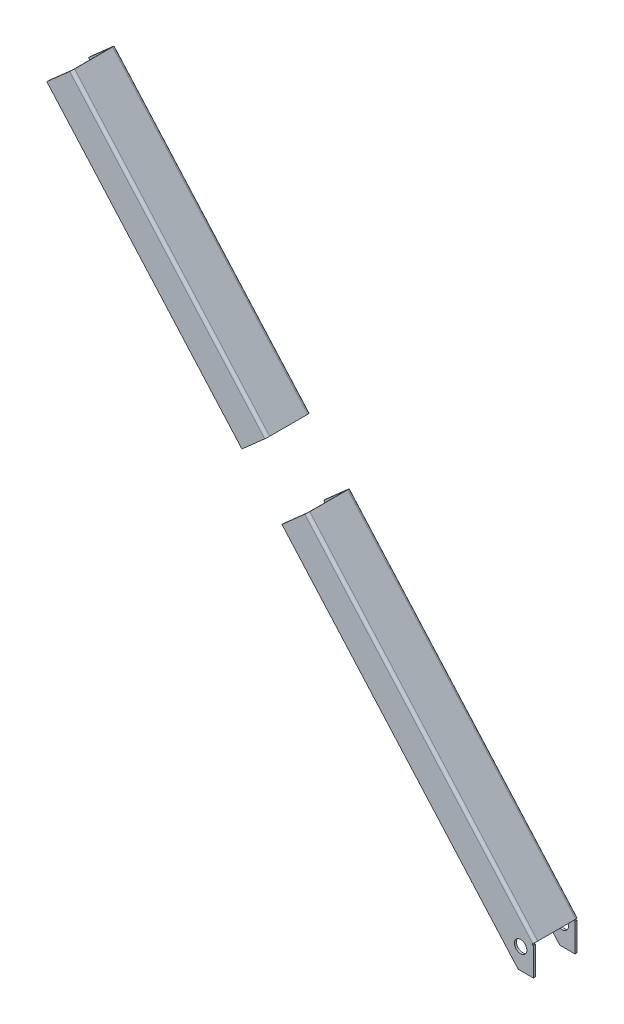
ISO-10303-21;
HEADER;
FILE_DESCRIPTION(('STEP AP214'),'2;1');
FILE_NAME('part.step','',(''),(''),'','','');
FILE_SCHEMA(('AUTOMOTIVE_DESIGN { 1 0 10303 214 1 1 1 1 }'));
ENDSEC;
DATA;
#1=APPLICATION_CONTEXT('core data for automotive mechanical design processes');
#2=APPLICATION_PROTOCOL_DEFINITION('international standard','automotive_design',2000,#1);
#3=PRODUCT_CONTEXT('',#1,'mechanical');
#4=PRODUCT('Part','Part','',(#3));
#5=PRODUCT_RELATED_PRODUCT_CATEGORY('part','',(#4));
#6=PRODUCT_DEFINITION_FORMATION('','',#4);
#7=PRODUCT_DEFINITION_CONTEXT('part definition',#1,'design');
#8=PRODUCT_DEFINITION('design','',#6,#7);
#9=PRODUCT_DEFINITION_SHAPE('','',#8);
#10=(LENGTH_UNIT() NAMED_UNIT(*) SI_UNIT(.MILLI.,.METRE.));
#11=(NAMED_UNIT(*) PLANE_ANGLE_UNIT() SI_UNIT($,.RADIAN.));
#12=(NAMED_UNIT(*) SI_UNIT($,.STERADIAN.) SOLID_ANGLE_UNIT());
#13=UNCERTAINTY_MEASURE_WITH_UNIT(LENGTH_MEASURE(1.E-05),#10,'distance_accuracy_value','');
#14=(GEOMETRIC_REPRESENTATION_CONTEXT(3) GLOBAL_UNCERTAINTY_ASSIGNED_CONTEXT((#13)) GLOBAL_UNIT_ASSIGNED_CONTEXT((#10,
#11,#12)) REPRESENTATION_CONTEXT('',''));
#15=CARTESIAN_POINT('',(0.,0.,0.));
#16=DIRECTION('',(0.,0.,1.));
#17=DIRECTION('',(1.,0.,0.));
#18=AXIS2_PLACEMENT_3D('',#15,#16,#17);
#19=CARTESIAN_POINT('',(142.888002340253,87.573537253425,130.));
#20=DIRECTION('',(0.662453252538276,-0.749103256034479,0.));
#21=DIRECTION('',(0.749103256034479,0.662453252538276,0.));
#22=AXIS2_PLACEMENT_3D('',#19,#20,#21);
#23=PLANE('',#22);
#24=DIRECTION('',(0.749103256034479,0.662453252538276,0.));
#25=VECTOR('',#24,1.);
#26=CARTESIAN_POINT('',(19.2475792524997,-21.7651951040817,40.0000000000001));
#27=LINE('',#26,#25);
#28=CARTESIAN_POINT('',(7.8529414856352,-31.8417964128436,40.0000000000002));
#29=VERTEX_POINT('',#28);
#30=CARTESIAN_POINT('',(29.7742497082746,-12.4561619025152,40.));
#31=VERTEX_POINT('',#30);
#32=EDGE_CURVE('E203',#29,#31,#27,.T.);
#33=ORIENTED_EDGE('',*,*,#32,.T.);
#34=DIRECTION('',(0.,0.,-1.));
#35=VECTOR('',#34,1.);
#36=CARTESIAN_POINT('',(29.7742497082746,-12.4561619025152,40.));
#37=LINE('',#36,#35);
#38=CARTESIAN_POINT('',(29.7742497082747,-12.456161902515,38.));
#39=VERTEX_POINT('',#38);
#40=EDGE_CURVE('E12',#31,#39,#37,.T.);
#41=ORIENTED_EDGE('',*,*,#40,.T.);
#42=DIRECTION('',(0.749103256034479,0.662453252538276,0.));
#43=VECTOR('',#42,1.);
#44=CARTESIAN_POINT('',(19.2475792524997,-21.7651951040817,38.0000000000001));
#45=LINE('',#44,#43);
#46=CARTESIAN_POINT('',(7.8529414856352,-31.8417964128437,38.0000000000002));
#47=VERTEX_POINT('',#46);
#48=EDGE_CURVE('E154',#47,#39,#45,.T.);
#49=ORIENTED_EDGE('',*,*,#48,.F.);
#50=DIRECTION('',(0.,0.,1.));
#51=VECTOR('',#50,1.);
#52=CARTESIAN_POINT('',(7.8529414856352,-31.8417964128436,40.0000000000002));
#53=LINE('',#52,#51);
#54=EDGE_CURVE('E206',#47,#29,#53,.T.);
#55=ORIENTED_EDGE('',*,*,#54,.T.);
#56=EDGE_LOOP('',(#33,#41,#49,#55));
#57=FACE_BOUND('',#56,.T.);
#58=ADVANCED_FACE('F49',(#57),#23,.F.);
#59=DIRECTION('',(0.,0.,-1.));
#60=VECTOR('',#59,1.);
#61=CARTESIAN_POINT('',(30.3260391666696,-11.9681988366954,0.));
#62=LINE('',#61,#60);
#63=CARTESIAN_POINT('',(30.3260391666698,-11.9681988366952,37.2634));
#64=VERTEX_POINT('',#63);
#65=CARTESIAN_POINT('',(30.3260391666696,-11.9681988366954,0.736600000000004));
#66=VERTEX_POINT('',#65);
#67=EDGE_CURVE('E220',#64,#66,#62,.T.);
#68=ORIENTED_EDGE('',*,*,#67,.F.);
#69=DIRECTION('',(0.749103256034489,0.662453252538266,0.));
#70=VECTOR('',#69,1.);
#71=CARTESIAN_POINT('',(30.3260391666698,-11.9681988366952,37.2634));
#72=LINE('',#71,#70);
#73=CARTESIAN_POINT('',(31.8242456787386,-10.6432923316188,37.2634));
#74=VERTEX_POINT('',#73);
#75=EDGE_CURVE('E58',#64,#74,#72,.T.);
#76=ORIENTED_EDGE('',*,*,#75,.T.);
#77=DIRECTION('',(0.,0.,-1.));
#78=VECTOR('',#77,1.);
#79=CARTESIAN_POINT('',(31.8242456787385,-10.6432923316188,0.));
#80=LINE('',#79,#78);
#81=CARTESIAN_POINT('',(31.8242456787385,-10.6432923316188,0.736599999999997));
#82=VERTEX_POINT('',#81);
#83=EDGE_CURVE('E198',#74,#82,#80,.T.);
#84=ORIENTED_EDGE('',*,*,#83,.T.);
#85=DIRECTION('',(-0.749103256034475,-0.662453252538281,0.));
#86=VECTOR('',#85,1.);
#87=CARTESIAN_POINT('',(31.8242456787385,-10.6432923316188,0.736599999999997));
#88=LINE('',#87,#86);
#89=EDGE_CURVE('E66',#82,#66,#88,.T.);
#90=ORIENTED_EDGE('',*,*,#89,.T.);
#91=EDGE_LOOP('',(#68,#76,#84,#90));
#92=FACE_BOUND('',#91,.T.);
#93=ADVANCED_FACE('F420',(#92),#23,.F.);
#94=DIRECTION('',(-0.749103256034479,-0.662453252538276,0.));
#95=VECTOR('',#94,1.);
#96=CARTESIAN_POINT('',(19.2475792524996,-21.7651951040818,0.));
#97=LINE('',#96,#95);
#98=CARTESIAN_POINT('',(29.7742497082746,-12.456161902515,0.));
#99=VERTEX_POINT('',#98);
#100=CARTESIAN_POINT('',(7.85294148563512,-31.8417964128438,0.));
#101=VERTEX_POINT('',#100);
#102=EDGE_CURVE('E210',#99,#101,#97,.T.);
#103=ORIENTED_EDGE('',*,*,#102,.F.);
#104=DIRECTION('',(0.,0.,-1.));
#105=VECTOR('',#104,1.);
#106=CARTESIAN_POINT('',(29.7742497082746,-12.456161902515,0.));
#107=LINE('',#106,#105);
#108=CARTESIAN_POINT('',(29.7742497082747,-12.456161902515,-2.));
#109=VERTEX_POINT('',#108);
#110=EDGE_CURVE('E102',#99,#109,#107,.T.);
#111=ORIENTED_EDGE('',*,*,#110,.T.);
#112=DIRECTION('',(-0.749103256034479,-0.662453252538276,0.));
#113=VECTOR('',#112,1.);
#114=CARTESIAN_POINT('',(142.888002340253,87.573537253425,-2.));
#115=LINE('',#114,#113);
#116=CARTESIAN_POINT('',(7.85294148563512,-31.8417964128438,-2.));
#117=VERTEX_POINT('',#116);
#118=EDGE_CURVE('E98',#109,#117,#115,.T.);
#119=ORIENTED_EDGE('',*,*,#118,.T.);
#120=DIRECTION('',(0.,0.,1.));
#121=VECTOR('',#120,1.);
#122=CARTESIAN_POINT('',(7.85294148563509,-31.8417964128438,-2.));
#123=LINE('',#122,#121);
#124=EDGE_CURVE('E204',#117,#101,#123,.T.);
#125=ORIENTED_EDGE('',*,*,#124,.T.);
#126=EDGE_LOOP('',(#103,#111,#119,#125));
#127=FACE_BOUND('',#126,.T.);
#128=ADVANCED_FACE('F455',(#127),#23,.F.);
#129=ORIENTED_EDGE('',*,*,#40,.F.);
#130=CARTESIAN_POINT('',(29.7742497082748,-12.4561619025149,37.2634));
#131=DIRECTION('',(0.662453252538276,-0.749103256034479,0.));
#132=DIRECTION('',(0.749103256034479,0.662453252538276,0.));
#133=AXIS2_PLACEMENT_3D('',#130,#131,#132);
#134=CIRCLE('',#133,2.73659999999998);
#135=EDGE_CURVE('E200',#31,#74,#134,.F.);
#136=ORIENTED_EDGE('',*,*,#135,.T.);
#137=ORIENTED_EDGE('',*,*,#75,.F.);
#138=CARTESIAN_POINT('',(29.7742497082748,-12.4561619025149,37.2634));
#139=DIRECTION('',(0.662453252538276,-0.749103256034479,0.));
#140=DIRECTION('',(0.749103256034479,0.662453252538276,0.));
#141=AXIS2_PLACEMENT_3D('',#138,#139,#140);
#142=CIRCLE('',#141,0.736599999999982);
#143=EDGE_CURVE('E252',#39,#64,#142,.F.);
#144=ORIENTED_EDGE('',*,*,#143,.F.);
#145=EDGE_LOOP('',(#129,#136,#137,#144));
#146=FACE_BOUND('',#145,.T.);
#147=ADVANCED_FACE('F417',(#146),#23,.F.);
#148=CARTESIAN_POINT('',(0.,0.,-2.));
#149=DIRECTION('',(0.,0.,-1.));
#150=DIRECTION('',(-1.,0.,0.));
#151=AXIS2_PLACEMENT_3D('',#148,#149,#150);
#152=PLANE('',#151);
#153=ORIENTED_EDGE('',*,*,#118,.F.);
#154=DIRECTION('',(-0.662453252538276,0.749103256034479,0.));
#155=VECTOR('',#154,1.);
#156=CARTESIAN_POINT('',(-234.983443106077,286.932283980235,-1.99999999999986));
#157=LINE('',#156,#155);
#158=CARTESIAN_POINT('',(248.942582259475,-260.292082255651,-2.));
#159=VERTEX_POINT('',#158);
#160=EDGE_CURVE('E232',#109,#159,#157,.F.);
#161=ORIENTED_EDGE('',*,*,#160,.T.);
#162=DIRECTION('',(-0.749103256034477,-0.662453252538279,0.));
#163=VECTOR('',#162,1.);
#164=CARTESIAN_POINT('',(238.415911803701,-269.601115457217,-2.));
#165=LINE('',#164,#163);
#166=CARTESIAN_POINT('',(248.193479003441,-260.954535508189,-2.));
#167=VERTEX_POINT('',#166);
#168=EDGE_CURVE('E235',#159,#167,#165,.T.);
#169=ORIENTED_EDGE('',*,*,#168,.T.);
#170=DIRECTION('',(0.662453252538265,-0.749103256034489,0.));
#171=VECTOR('',#170,1.);
#172=CARTESIAN_POINT('',(9.77756719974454,8.64657994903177,-2.));
#173=LINE('',#172,#171);
#174=CARTESIAN_POINT('',(248.855932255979,-261.703638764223,-2.));
#175=VERTEX_POINT('',#174);
#176=EDGE_CURVE('E288',#167,#175,#173,.T.);
#177=ORIENTED_EDGE('',*,*,#176,.T.);
#178=DIRECTION('',(0.749103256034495,0.662453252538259,0.));
#179=VECTOR('',#178,1.);
#180=CARTESIAN_POINT('',(239.078365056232,-270.350218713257,-2.));
#181=LINE('',#180,#179);
#182=CARTESIAN_POINT('',(249.49437171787,-261.139048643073,-2.));
#183=VERTEX_POINT('',#182);
#184=EDGE_CURVE('E285',#175,#183,#181,.T.);
#185=ORIENTED_EDGE('',*,*,#184,.T.);
#186=DIRECTION('',(0.,1.,0.));
#187=VECTOR('',#186,1.);
#188=CARTESIAN_POINT('',(249.49437171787,-288.579752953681,-2.));
#189=LINE('',#188,#187);
#190=CARTESIAN_POINT('',(249.49437171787,-288.579752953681,-2.));
#191=VERTEX_POINT('',#190);
#192=EDGE_CURVE('E264',#191,#183,#189,.T.);
#193=ORIENTED_EDGE('',*,*,#192,.F.);
#194=DIRECTION('',(1.,0.,0.));
#195=VECTOR('',#194,1.);
#196=CARTESIAN_POINT('',(249.49437171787,-288.579752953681,-2.));
#197=LINE('',#196,#195);
#198=CARTESIAN_POINT('',(234.893597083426,-288.57975295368,-2.));
#199=VERTEX_POINT('',#198);
#200=EDGE_CURVE('E271',#199,#191,#197,.T.);
#201=ORIENTED_EDGE('',*,*,#200,.F.);
#202=DIRECTION('',(0.662453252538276,-0.749103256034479,0.));
#203=VECTOR('',#202,1.);
#204=CARTESIAN_POINT('',(-249.032428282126,258.644613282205,-2.));
#205=LINE('',#204,#203);
#206=EDGE_CURVE('E227',#117,#199,#205,.T.);
#207=ORIENTED_EDGE('',*,*,#206,.F.);
#208=EDGE_LOOP('',(#153,#161,#169,#177,#185,#193,#201,#207));
#209=FACE_BOUND('',#208,.T.);
#210=CARTESIAN_POINT('',(237.23097171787,-268.57975295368,-2.));
#211=DIRECTION('',(0.,0.,1.));
#212=DIRECTION('',(1.,0.,0.));
#213=AXIS2_PLACEMENT_3D('',#210,#211,#212);
#214=CIRCLE('',#213,6.00000000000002);
#215=CARTESIAN_POINT('',(243.23097171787,-268.57975295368,-2.));
#216=VERTEX_POINT('',#215);
#217=EDGE_CURVE('E214',#216,#216,#214,.T.);
#218=ORIENTED_EDGE('',*,*,#217,.T.);
#219=EDGE_LOOP('',(#218));
#220=FACE_BOUND('',#219,.T.);
#221=ADVANCED_FACE('F51',(#209,#220),#152,.T.);
#222=CARTESIAN_POINT('',(0.,0.,0.));
#223=DIRECTION('',(0.,0.,-1.));
#224=DIRECTION('',(-1.,0.,0.));
#225=AXIS2_PLACEMENT_3D('',#222,#223,#224);
#226=PLANE('',#225);
#227=CARTESIAN_POINT('',(237.23097171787,-268.57975295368,0.));
#228=DIRECTION('',(0.,0.,1.));
#229=DIRECTION('',(1.,0.,0.));
#230=AXIS2_PLACEMENT_3D('',#227,#228,#229);
#231=CIRCLE('',#230,6.00000000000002);
#232=CARTESIAN_POINT('',(243.23097171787,-268.57975295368,0.));
#233=VERTEX_POINT('',#232);
#234=EDGE_CURVE('E270',#233,#233,#231,.T.);
#235=ORIENTED_EDGE('',*,*,#234,.F.);
#236=EDGE_LOOP('',(#235));
#237=FACE_BOUND('',#236,.T.);
#238=DIRECTION('',(-0.662453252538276,0.749103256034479,0.));
#239=VECTOR('',#238,1.);
#240=CARTESIAN_POINT('',(-234.983443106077,286.932283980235,1.35742111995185E-13));
#241=LINE('',#240,#239);
#242=CARTESIAN_POINT('',(248.942582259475,-260.292082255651,0.));
#243=VERTEX_POINT('',#242);
#244=EDGE_CURVE('E218',#99,#243,#241,.F.);
#245=ORIENTED_EDGE('',*,*,#244,.F.);
#246=ORIENTED_EDGE('',*,*,#102,.T.);
#247=DIRECTION('',(0.662453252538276,-0.749103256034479,0.));
#248=VECTOR('',#247,1.);
#249=CARTESIAN_POINT('',(-249.032428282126,258.644613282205,0.));
#250=LINE('',#249,#248);
#251=CARTESIAN_POINT('',(234.893597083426,-288.57975295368,0.));
#252=VERTEX_POINT('',#251);
#253=EDGE_CURVE('E213',#101,#252,#250,.T.);
#254=ORIENTED_EDGE('',*,*,#253,.T.);
#255=DIRECTION('',(1.,0.,0.));
#256=VECTOR('',#255,1.);
#257=CARTESIAN_POINT('',(249.49437171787,-288.579752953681,0.));
#258=LINE('',#257,#256);
#259=CARTESIAN_POINT('',(249.49437171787,-288.579752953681,0.));
#260=VERTEX_POINT('',#259);
#261=EDGE_CURVE('E261',#252,#260,#258,.T.);
#262=ORIENTED_EDGE('',*,*,#261,.T.);
#263=DIRECTION('',(0.,1.,0.));
#264=VECTOR('',#263,1.);
#265=CARTESIAN_POINT('',(249.49437171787,-288.579752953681,0.));
#266=LINE('',#265,#264);
#267=CARTESIAN_POINT('',(249.49437171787,-261.139048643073,0.));
#268=VERTEX_POINT('',#267);
#269=EDGE_CURVE('E231',#260,#268,#266,.T.);
#270=ORIENTED_EDGE('',*,*,#269,.T.);
#271=DIRECTION('',(0.749103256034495,0.662453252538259,0.));
#272=VECTOR('',#271,1.);
#273=CARTESIAN_POINT('',(248.855932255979,-261.703638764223,0.));
#274=LINE('',#273,#272);
#275=CARTESIAN_POINT('',(248.855932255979,-261.703638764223,0.));
#276=VERTEX_POINT('',#275);
#277=EDGE_CURVE('E300',#276,#268,#274,.T.);
#278=ORIENTED_EDGE('',*,*,#277,.F.);
#279=DIRECTION('',(0.662453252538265,-0.749103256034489,0.));
#280=VECTOR('',#279,1.);
#281=CARTESIAN_POINT('',(248.193479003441,-260.954535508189,0.));
#282=LINE('',#281,#280);
#283=CARTESIAN_POINT('',(248.193479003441,-260.954535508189,0.));
#284=VERTEX_POINT('',#283);
#285=EDGE_CURVE('E296',#284,#276,#282,.T.);
#286=ORIENTED_EDGE('',*,*,#285,.F.);
#287=DIRECTION('',(-0.749103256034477,-0.662453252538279,0.));
#288=VECTOR('',#287,1.);
#289=CARTESIAN_POINT('',(248.942582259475,-260.292082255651,0.));
#290=LINE('',#289,#288);
#291=EDGE_CURVE('E282',#243,#284,#290,.T.);
#292=ORIENTED_EDGE('',*,*,#291,.F.);
#293=EDGE_LOOP('',(#245,#246,#254,#262,#270,#278,#286,#292));
#294=FACE_BOUND('',#293,.T.);
#295=ADVANCED_FACE('F452',(#237,#294),#226,.F.);
#296=CARTESIAN_POINT('',(-249.032428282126,258.644613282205,-2.));
#297=DIRECTION('',(-0.749103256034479,-0.662453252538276,0.));
#298=DIRECTION('',(0.662453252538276,-0.749103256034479,0.));
#299=AXIS2_PLACEMENT_3D('',#296,#297,#298);
#300=PLANE('',#299);
#301=ORIENTED_EDGE('',*,*,#124,.F.);
#302=ORIENTED_EDGE('',*,*,#206,.T.);
#303=DIRECTION('',(0.,0.,1.));
#304=VECTOR('',#303,1.);
#305=CARTESIAN_POINT('',(234.893597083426,-288.57975295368,-2.));
#306=LINE('',#305,#304);
#307=EDGE_CURVE('E230',#199,#252,#306,.T.);
#308=ORIENTED_EDGE('',*,*,#307,.T.);
#309=ORIENTED_EDGE('',*,*,#253,.F.);
#310=EDGE_LOOP('',(#301,#302,#308,#309));
#311=FACE_BOUND('',#310,.T.);
#312=ADVANCED_FACE('F444',(#311),#300,.T.);
#313=CARTESIAN_POINT('',(-234.983443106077,286.932283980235,0.736600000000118));
#314=DIRECTION('',(-0.662453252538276,0.749103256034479,0.));
#315=DIRECTION('',(0.749103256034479,0.662453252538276,0.));
#316=AXIS2_PLACEMENT_3D('',#313,#314,#315);
#317=CYLINDRICAL_SURFACE('',#316,2.73659999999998);
#318=CARTESIAN_POINT('',(29.7742497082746,-12.456161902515,0.736600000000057));
#319=DIRECTION('',(0.662453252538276,-0.749103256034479,0.));
#320=DIRECTION('',(0.749103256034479,0.662453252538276,0.));
#321=AXIS2_PLACEMENT_3D('',#318,#319,#320);
#322=CIRCLE('',#321,2.73659999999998);
#323=EDGE_CURVE('E168',#82,#109,#322,.F.);
#324=ORIENTED_EDGE('',*,*,#323,.F.);
#325=DIRECTION('',(-0.662453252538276,0.749103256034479,0.));
#326=VECTOR('',#325,1.);
#327=CARTESIAN_POINT('',(12.5766664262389,11.121902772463,0.736600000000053));
#328=LINE('',#327,#326);
#329=CARTESIAN_POINT('',(250.992578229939,-258.479212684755,0.736599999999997));
#330=VERTEX_POINT('',#329);
#331=EDGE_CURVE('E239',#330,#82,#328,.T.);
#332=ORIENTED_EDGE('',*,*,#331,.F.);
#333=CARTESIAN_POINT('',(248.942582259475,-260.292082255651,0.736600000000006));
#334=DIRECTION('',(-0.662453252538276,0.749103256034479,0.));
#335=DIRECTION('',(-0.749103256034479,-0.662453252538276,0.));
#336=AXIS2_PLACEMENT_3D('',#333,#334,#335);
#337=CIRCLE('',#336,2.73659999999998);
#338=EDGE_CURVE('E313',#159,#330,#337,.F.);
#339=ORIENTED_EDGE('',*,*,#338,.F.);
#340=ORIENTED_EDGE('',*,*,#160,.F.);
#341=EDGE_LOOP('',(#324,#332,#339,#340));
#342=FACE_BOUND('',#341,.T.);
#343=ADVANCED_FACE('F434',(#342),#317,.T.);
#344=CARTESIAN_POINT('',(-234.983443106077,286.932283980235,0.736600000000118));
#345=DIRECTION('',(-0.662453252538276,0.749103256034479,0.));
#346=DIRECTION('',(0.749103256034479,0.662453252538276,0.));
#347=AXIS2_PLACEMENT_3D('',#344,#345,#346);
#348=CYLINDRICAL_SURFACE('',#347,0.736599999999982);
#349=DIRECTION('',(-0.662453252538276,0.749103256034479,0.));
#350=VECTOR('',#349,1.);
#351=CARTESIAN_POINT('',(249.49437171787,-259.804119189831,0.736600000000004));
#352=LINE('',#351,#350);
#353=CARTESIAN_POINT('',(249.49437171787,-259.804119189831,0.736600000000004));
#354=VERTEX_POINT('',#353);
#355=EDGE_CURVE('E219',#354,#66,#352,.T.);
#356=ORIENTED_EDGE('',*,*,#355,.T.);
#357=CARTESIAN_POINT('',(29.7742497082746,-12.456161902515,0.736600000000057));
#358=DIRECTION('',(0.662453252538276,-0.749103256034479,0.));
#359=DIRECTION('',(0.749103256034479,0.662453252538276,0.));
#360=AXIS2_PLACEMENT_3D('',#357,#358,#359);
#361=CIRCLE('',#360,0.736599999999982);
#362=EDGE_CURVE('E215',#66,#99,#361,.F.);
#363=ORIENTED_EDGE('',*,*,#362,.T.);
#364=ORIENTED_EDGE('',*,*,#244,.T.);
#365=CARTESIAN_POINT('',(248.942582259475,-260.292082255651,0.736600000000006));
#366=DIRECTION('',(-0.662453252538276,0.749103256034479,0.));
#367=DIRECTION('',(-0.749103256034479,-0.662453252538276,0.));
#368=AXIS2_PLACEMENT_3D('',#365,#366,#367);
#369=CIRCLE('',#368,0.736599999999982);
#370=EDGE_CURVE('E238',#243,#354,#369,.F.);
#371=ORIENTED_EDGE('',*,*,#370,.T.);
#372=EDGE_LOOP('',(#356,#363,#364,#371));
#373=FACE_BOUND('',#372,.T.);
#374=ADVANCED_FACE('F457',(#373),#348,.F.);
#375=CARTESIAN_POINT('',(12.5766664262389,11.121902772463,0.));
#376=DIRECTION('',(0.749103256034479,0.662453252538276,0.));
#377=DIRECTION('',(-0.662453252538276,0.749103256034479,0.));
#378=AXIS2_PLACEMENT_3D('',#375,#376,#377);
#379=PLANE('',#378);
#380=ORIENTED_EDGE('',*,*,#83,.F.);
#381=DIRECTION('',(-0.662453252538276,0.749103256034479,0.));
#382=VECTOR('',#381,1.);
#383=CARTESIAN_POINT('',(12.576666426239,11.1219027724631,37.2634));
#384=LINE('',#383,#382);
#385=CARTESIAN_POINT('',(250.992578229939,-258.479212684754,37.2634));
#386=VERTEX_POINT('',#385);
#387=EDGE_CURVE('E194',#386,#74,#384,.T.);
#388=ORIENTED_EDGE('',*,*,#387,.F.);
#389=DIRECTION('',(0.,0.,1.));
#390=VECTOR('',#389,1.);
#391=CARTESIAN_POINT('',(250.992578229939,-258.479212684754,19.));
#392=LINE('',#391,#390);
#393=EDGE_CURVE('E320',#330,#386,#392,.T.);
#394=ORIENTED_EDGE('',*,*,#393,.F.);
#395=ORIENTED_EDGE('',*,*,#331,.T.);
#396=EDGE_LOOP('',(#380,#388,#394,#395));
#397=FACE_BOUND('',#396,.T.);
#398=ADVANCED_FACE('F430',(#397),#379,.T.);
#399=CARTESIAN_POINT('',(11.07845991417,9.79699626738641,0.));
#400=DIRECTION('',(0.749103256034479,0.662453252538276,0.));
#401=DIRECTION('',(-0.662453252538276,0.749103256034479,0.));
#402=AXIS2_PLACEMENT_3D('',#399,#400,#401);
#403=PLANE('',#402);
#404=DIRECTION('',(-0.662453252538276,0.749103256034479,0.));
#405=VECTOR('',#404,1.);
#406=CARTESIAN_POINT('',(249.49437171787,-259.804119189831,37.2634));
#407=LINE('',#406,#405);
#408=CARTESIAN_POINT('',(249.49437171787,-259.804119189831,37.2634));
#409=VERTEX_POINT('',#408);
#410=EDGE_CURVE('E164',#409,#64,#407,.T.);
#411=ORIENTED_EDGE('',*,*,#410,.T.);
#412=ORIENTED_EDGE('',*,*,#67,.T.);
#413=ORIENTED_EDGE('',*,*,#355,.F.);
#414=DIRECTION('',(0.,0.,1.));
#415=VECTOR('',#414,1.);
#416=CARTESIAN_POINT('',(249.49437171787,-259.804119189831,19.));
#417=LINE('',#416,#415);
#418=EDGE_CURVE('E223',#354,#409,#417,.T.);
#419=ORIENTED_EDGE('',*,*,#418,.T.);
#420=EDGE_LOOP('',(#411,#412,#413,#419));
#421=FACE_BOUND('',#420,.T.);
#422=ADVANCED_FACE('F423',(#421),#403,.F.);
#423=CARTESIAN_POINT('',(1.09850161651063E-13,0.,40.0000000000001));
#424=DIRECTION('',(0.,0.,1.));
#425=DIRECTION('',(-1.,0.,0.));
#426=AXIS2_PLACEMENT_3D('',#423,#424,#425);
#427=PLANE('',#426);
#428=ORIENTED_EDGE('',*,*,#32,.F.);
#429=DIRECTION('',(0.662453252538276,-0.749103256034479,0.));
#430=VECTOR('',#429,1.);
#431=CARTESIAN_POINT('',(-249.032428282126,258.644613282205,40.0000000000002));
#432=LINE('',#431,#430);
#433=CARTESIAN_POINT('',(234.893597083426,-288.57975295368,40.0000000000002));
#434=VERTEX_POINT('',#433);
#435=EDGE_CURVE('E244',#29,#434,#432,.T.);
#436=ORIENTED_EDGE('',*,*,#435,.T.);
#437=DIRECTION('',(1.,0.,0.));
#438=VECTOR('',#437,1.);
#439=CARTESIAN_POINT('',(249.49437171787,-288.57975295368,40.0000000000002));
#440=LINE('',#439,#438);
#441=CARTESIAN_POINT('',(249.49437171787,-288.57975295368,40.0000000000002));
#442=VERTEX_POINT('',#441);
#443=EDGE_CURVE('E246',#434,#442,#440,.T.);
#444=ORIENTED_EDGE('',*,*,#443,.T.);
#445=DIRECTION('',(0.,1.,0.));
#446=VECTOR('',#445,1.);
#447=CARTESIAN_POINT('',(249.49437171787,-288.57975295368,40.0000000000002));
#448=LINE('',#447,#446);
#449=CARTESIAN_POINT('',(249.49437171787,-261.139048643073,40.));
#450=VERTEX_POINT('',#449);
#451=EDGE_CURVE('E339',#442,#450,#448,.T.);
#452=ORIENTED_EDGE('',*,*,#451,.T.);
#453=DIRECTION('',(0.749103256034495,0.662453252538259,0.));
#454=VECTOR('',#453,1.);
#455=CARTESIAN_POINT('',(239.078365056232,-270.350218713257,40.0000000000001));
#456=LINE('',#455,#454);
#457=CARTESIAN_POINT('',(248.855932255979,-261.703638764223,40.));
#458=VERTEX_POINT('',#457);
#459=EDGE_CURVE('E348',#458,#450,#456,.T.);
#460=ORIENTED_EDGE('',*,*,#459,.F.);
#461=DIRECTION('',(0.662453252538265,-0.749103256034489,0.));
#462=VECTOR('',#461,1.);
#463=CARTESIAN_POINT('',(9.77756719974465,8.64657994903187,40.));
#464=LINE('',#463,#462);
#465=CARTESIAN_POINT('',(248.193479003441,-260.954535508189,40.));
#466=VERTEX_POINT('',#465);
#467=EDGE_CURVE('E180',#466,#458,#464,.T.);
#468=ORIENTED_EDGE('',*,*,#467,.F.);
#469=DIRECTION('',(-0.749103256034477,-0.662453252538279,0.));
#470=VECTOR('',#469,1.);
#471=CARTESIAN_POINT('',(238.415911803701,-269.601115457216,40.0000000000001));
#472=LINE('',#471,#470);
#473=CARTESIAN_POINT('',(248.942582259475,-260.292082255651,40.));
#474=VERTEX_POINT('',#473);
#475=EDGE_CURVE('E181',#474,#466,#472,.T.);
#476=ORIENTED_EDGE('',*,*,#475,.F.);
#477=DIRECTION('',(-0.662453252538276,0.749103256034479,0.));
#478=VECTOR('',#477,1.);
#479=CARTESIAN_POINT('',(-234.983443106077,286.932283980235,39.9999999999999));
#480=LINE('',#479,#478);
#481=EDGE_CURVE('E195',#31,#474,#480,.F.);
#482=ORIENTED_EDGE('',*,*,#481,.F.);
#483=EDGE_LOOP('',(#428,#436,#444,#452,#460,#468,#476,#482));
#484=FACE_BOUND('',#483,.T.);
#485=CARTESIAN_POINT('',(237.23097171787,-268.57975295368,40.0000000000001));
#486=DIRECTION('',(0.,0.,1.));
#487=DIRECTION('',(1.,0.,0.));
#488=AXIS2_PLACEMENT_3D('',#485,#486,#487);
#489=CIRCLE('',#488,6.00000000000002);
#490=CARTESIAN_POINT('',(243.23097171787,-268.57975295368,40.0000000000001));
#491=VERTEX_POINT('',#490);
#492=EDGE_CURVE('E329',#491,#491,#489,.T.);
#493=ORIENTED_EDGE('',*,*,#492,.F.);
#494=EDGE_LOOP('',(#493));
#495=FACE_BOUND('',#494,.T.);
#496=ADVANCED_FACE('F375',(#484,#495),#427,.T.);
#497=CARTESIAN_POINT('',(0.,0.,38.0000000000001));
#498=DIRECTION('',(0.,0.,1.));
#499=DIRECTION('',(-1.,0.,0.));
#500=AXIS2_PLACEMENT_3D('',#497,#498,#499);
#501=PLANE('',#500);
#502=CARTESIAN_POINT('',(237.23097171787,-268.57975295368,38.0000000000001));
#503=DIRECTION('',(0.,0.,1.));
#504=DIRECTION('',(1.,0.,0.));
#505=AXIS2_PLACEMENT_3D('',#502,#503,#504);
#506=CIRCLE('',#505,6.00000000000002);
#507=CARTESIAN_POINT('',(243.23097171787,-268.57975295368,38.0000000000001));
#508=VERTEX_POINT('',#507);
#509=EDGE_CURVE('E225',#508,#508,#506,.T.);
#510=ORIENTED_EDGE('',*,*,#509,.T.);
#511=EDGE_LOOP('',(#510));
#512=FACE_BOUND('',#511,.T.);
#513=DIRECTION('',(0.662453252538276,-0.749103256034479,0.));
#514=VECTOR('',#513,1.);
#515=CARTESIAN_POINT('',(-249.032428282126,258.644613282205,38.0000000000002));
#516=LINE('',#515,#514);
#517=CARTESIAN_POINT('',(234.893597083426,-288.57975295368,38.0000000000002));
#518=VERTEX_POINT('',#517);
#519=EDGE_CURVE('E248',#47,#518,#516,.T.);
#520=ORIENTED_EDGE('',*,*,#519,.F.);
#521=ORIENTED_EDGE('',*,*,#48,.T.);
#522=DIRECTION('',(-0.662453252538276,0.749103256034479,0.));
#523=VECTOR('',#522,1.);
#524=CARTESIAN_POINT('',(-234.983443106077,286.932283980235,37.9999999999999));
#525=LINE('',#524,#523);
#526=CARTESIAN_POINT('',(248.942582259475,-260.292082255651,38.));
#527=VERTEX_POINT('',#526);
#528=EDGE_CURVE('E147',#39,#527,#525,.F.);
#529=ORIENTED_EDGE('',*,*,#528,.T.);
#530=DIRECTION('',(-0.749103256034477,-0.662453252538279,0.));
#531=VECTOR('',#530,1.);
#532=CARTESIAN_POINT('',(248.942582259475,-260.292082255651,38.));
#533=LINE('',#532,#531);
#534=CARTESIAN_POINT('',(248.193479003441,-260.954535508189,38.));
#535=VERTEX_POINT('',#534);
#536=EDGE_CURVE('E153',#527,#535,#533,.T.);
#537=ORIENTED_EDGE('',*,*,#536,.T.);
#538=DIRECTION('',(0.662453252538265,-0.749103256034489,0.));
#539=VECTOR('',#538,1.);
#540=CARTESIAN_POINT('',(248.193479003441,-260.954535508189,38.));
#541=LINE('',#540,#539);
#542=CARTESIAN_POINT('',(248.855932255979,-261.703638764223,38.));
#543=VERTEX_POINT('',#542);
#544=EDGE_CURVE('E187',#535,#543,#541,.T.);
#545=ORIENTED_EDGE('',*,*,#544,.T.);
#546=DIRECTION('',(0.749103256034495,0.662453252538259,0.));
#547=VECTOR('',#546,1.);
#548=CARTESIAN_POINT('',(248.855932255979,-261.703638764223,38.));
#549=LINE('',#548,#547);
#550=CARTESIAN_POINT('',(249.49437171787,-261.139048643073,38.));
#551=VERTEX_POINT('',#550);
#552=EDGE_CURVE('E189',#543,#551,#549,.T.);
#553=ORIENTED_EDGE('',*,*,#552,.T.);
#554=DIRECTION('',(0.,1.,0.));
#555=VECTOR('',#554,1.);
#556=CARTESIAN_POINT('',(249.49437171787,-288.57975295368,38.0000000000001));
#557=LINE('',#556,#555);
#558=CARTESIAN_POINT('',(249.49437171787,-288.57975295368,38.0000000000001));
#559=VERTEX_POINT('',#558);
#560=EDGE_CURVE('E333',#559,#551,#557,.T.);
#561=ORIENTED_EDGE('',*,*,#560,.F.);
#562=DIRECTION('',(1.,0.,0.));
#563=VECTOR('',#562,1.);
#564=CARTESIAN_POINT('',(249.49437171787,-288.57975295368,38.0000000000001));
#565=LINE('',#564,#563);
#566=EDGE_CURVE('E330',#518,#559,#565,.T.);
#567=ORIENTED_EDGE('',*,*,#566,.F.);
#568=EDGE_LOOP('',(#520,#521,#529,#537,#545,#553,#561,#567));
#569=FACE_BOUND('',#568,.T.);
#570=ADVANCED_FACE('F150',(#512,#569),#501,.F.);
#571=CARTESIAN_POINT('',(-249.032428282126,258.644613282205,40.0000000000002));
#572=DIRECTION('',(-0.749103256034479,-0.662453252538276,0.));
#573=DIRECTION('',(0.662453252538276,-0.749103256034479,0.));
#574=AXIS2_PLACEMENT_3D('',#571,#572,#573);
#575=PLANE('',#574);
#576=ORIENTED_EDGE('',*,*,#54,.F.);
#577=ORIENTED_EDGE('',*,*,#519,.T.);
#578=DIRECTION('',(0.,0.,-1.));
#579=VECTOR('',#578,1.);
#580=CARTESIAN_POINT('',(234.893597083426,-288.57975295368,40.0000000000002));
#581=LINE('',#580,#579);
#582=EDGE_CURVE('E326',#434,#518,#581,.T.);
#583=ORIENTED_EDGE('',*,*,#582,.F.);
#584=ORIENTED_EDGE('',*,*,#435,.F.);
#585=EDGE_LOOP('',(#576,#577,#583,#584));
#586=FACE_BOUND('',#585,.T.);
#587=ADVANCED_FACE('F368',(#586),#575,.T.);
#588=CARTESIAN_POINT('',(-234.983443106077,286.932283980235,37.2633999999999));
#589=DIRECTION('',(-0.662453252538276,0.749103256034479,0.));
#590=DIRECTION('',(0.749103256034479,0.662453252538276,0.));
#591=AXIS2_PLACEMENT_3D('',#588,#589,#590);
#592=CYLINDRICAL_SURFACE('',#591,2.73659999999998);
#593=ORIENTED_EDGE('',*,*,#135,.F.);
#594=ORIENTED_EDGE('',*,*,#481,.T.);
#595=CARTESIAN_POINT('',(248.942582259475,-260.292082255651,37.2634));
#596=DIRECTION('',(0.662453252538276,-0.749103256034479,0.));
#597=DIRECTION('',(-0.749103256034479,-0.662453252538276,0.));
#598=AXIS2_PLACEMENT_3D('',#595,#596,#597);
#599=CIRCLE('',#598,2.73659999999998);
#600=EDGE_CURVE('E176',#474,#386,#599,.F.);
#601=ORIENTED_EDGE('',*,*,#600,.T.);
#602=ORIENTED_EDGE('',*,*,#387,.T.);
#603=EDGE_LOOP('',(#593,#594,#601,#602));
#604=FACE_BOUND('',#603,.T.);
#605=ADVANCED_FACE('F379',(#604),#592,.T.);
#606=CARTESIAN_POINT('',(-234.983443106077,286.932283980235,37.2633999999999));
#607=DIRECTION('',(-0.662453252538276,0.749103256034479,0.));
#608=DIRECTION('',(0.749103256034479,0.662453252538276,0.));
#609=AXIS2_PLACEMENT_3D('',#606,#607,#608);
#610=CYLINDRICAL_SURFACE('',#609,0.736599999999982);
#611=ORIENTED_EDGE('',*,*,#528,.F.);
#612=ORIENTED_EDGE('',*,*,#143,.T.);
#613=ORIENTED_EDGE('',*,*,#410,.F.);
#614=CARTESIAN_POINT('',(248.942582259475,-260.29208225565,37.2634));
#615=DIRECTION('',(0.662453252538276,-0.749103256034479,0.));
#616=DIRECTION('',(-0.749103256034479,-0.662453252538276,0.));
#617=AXIS2_PLACEMENT_3D('',#614,#615,#616);
#618=CIRCLE('',#617,0.736599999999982);
#619=EDGE_CURVE('E160',#527,#409,#618,.F.);
#620=ORIENTED_EDGE('',*,*,#619,.F.);
#621=EDGE_LOOP('',(#611,#612,#613,#620));
#622=FACE_BOUND('',#621,.T.);
#623=ADVANCED_FACE('F162',(#622),#610,.F.);
#624=CARTESIAN_POINT('',(249.49437171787,-288.579752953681,-2.));
#625=DIRECTION('',(1.,0.,0.));
#626=DIRECTION('',(0.,1.,0.));
#627=AXIS2_PLACEMENT_3D('',#624,#625,#626);
#628=PLANE('',#627);
#629=ORIENTED_EDGE('',*,*,#192,.T.);
#630=DIRECTION('',(0.,0.,-1.));
#631=VECTOR('',#630,1.);
#632=CARTESIAN_POINT('',(249.49437171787,-261.139048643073,0.));
#633=LINE('',#632,#631);
#634=EDGE_CURVE('E301',#268,#183,#633,.T.);
#635=ORIENTED_EDGE('',*,*,#634,.F.);
#636=ORIENTED_EDGE('',*,*,#269,.F.);
#637=DIRECTION('',(0.,0.,1.));
#638=VECTOR('',#637,1.);
#639=CARTESIAN_POINT('',(249.49437171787,-288.579752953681,-2.));
#640=LINE('',#639,#638);
#641=EDGE_CURVE('E267',#191,#260,#640,.T.);
#642=ORIENTED_EDGE('',*,*,#641,.F.);
#643=EDGE_LOOP('',(#629,#635,#636,#642));
#644=FACE_BOUND('',#643,.T.);
#645=ADVANCED_FACE('F474',(#644),#628,.T.);
#646=CARTESIAN_POINT('',(249.49437171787,-288.579752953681,-2.));
#647=DIRECTION('',(0.,-1.,0.));
#648=DIRECTION('',(1.,0.,0.));
#649=AXIS2_PLACEMENT_3D('',#646,#647,#648);
#650=PLANE('',#649);
#651=ORIENTED_EDGE('',*,*,#261,.F.);
#652=ORIENTED_EDGE('',*,*,#307,.F.);
#653=ORIENTED_EDGE('',*,*,#200,.T.);
#654=ORIENTED_EDGE('',*,*,#641,.T.);
#655=EDGE_LOOP('',(#651,#652,#653,#654));
#656=FACE_BOUND('',#655,.T.);
#657=ADVANCED_FACE('F448',(#656),#650,.T.);
#658=CARTESIAN_POINT('',(237.23097171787,-268.57975295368,-2.));
#659=DIRECTION('',(0.,0.,1.));
#660=DIRECTION('',(1.,0.,0.));
#661=AXIS2_PLACEMENT_3D('',#658,#659,#660);
#662=CYLINDRICAL_SURFACE('',#661,6.00000000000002);
#663=ORIENTED_EDGE('',*,*,#217,.F.);
#664=EDGE_LOOP('',(#663));
#665=FACE_BOUND('',#664,.T.);
#666=ORIENTED_EDGE('',*,*,#234,.T.);
#667=EDGE_LOOP('',(#666));
#668=FACE_BOUND('',#667,.T.);
#669=ADVANCED_FACE('F481',(#665,#668),#662,.F.);
#670=CARTESIAN_POINT('',(248.942582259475,-260.292082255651,0.));
#671=DIRECTION('',(0.662453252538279,-0.749103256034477,0.));
#672=DIRECTION('',(0.749103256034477,0.662453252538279,0.));
#673=AXIS2_PLACEMENT_3D('',#670,#671,#672);
#674=PLANE('',#673);
#675=ORIENTED_EDGE('',*,*,#168,.F.);
#676=DIRECTION('',(-3.01445295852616E-13,1.50722647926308E-13,-1.));
#677=VECTOR('',#676,1.);
#678=CARTESIAN_POINT('',(248.942582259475,-260.292082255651,0.));
#679=LINE('',#678,#677);
#680=EDGE_CURVE('E304',#243,#159,#679,.T.);
#681=ORIENTED_EDGE('',*,*,#680,.F.);
#682=ORIENTED_EDGE('',*,*,#291,.T.);
#683=DIRECTION('',(0.,0.,-1.));
#684=VECTOR('',#683,1.);
#685=CARTESIAN_POINT('',(248.193479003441,-260.954535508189,0.));
#686=LINE('',#685,#684);
#687=EDGE_CURVE('E293',#284,#167,#686,.T.);
#688=ORIENTED_EDGE('',*,*,#687,.T.);
#689=EDGE_LOOP('',(#675,#681,#682,#688));
#690=FACE_BOUND('',#689,.T.);
#691=ADVANCED_FACE('F465',(#690),#674,.T.);
#692=CARTESIAN_POINT('',(248.193479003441,-260.954535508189,0.));
#693=DIRECTION('',(0.749103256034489,0.662453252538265,0.));
#694=DIRECTION('',(-0.662453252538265,0.749103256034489,0.));
#695=AXIS2_PLACEMENT_3D('',#692,#693,#694);
#696=PLANE('',#695);
#697=ORIENTED_EDGE('',*,*,#176,.F.);
#698=ORIENTED_EDGE('',*,*,#687,.F.);
#699=ORIENTED_EDGE('',*,*,#285,.T.);
#700=DIRECTION('',(0.,0.,-1.));
#701=VECTOR('',#700,1.);
#702=CARTESIAN_POINT('',(248.855932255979,-261.703638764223,0.));
#703=LINE('',#702,#701);
#704=EDGE_CURVE('E297',#276,#175,#703,.T.);
#705=ORIENTED_EDGE('',*,*,#704,.T.);
#706=EDGE_LOOP('',(#697,#698,#699,#705));
#707=FACE_BOUND('',#706,.T.);
#708=ADVANCED_FACE('F469',(#707),#696,.T.);
#709=CARTESIAN_POINT('',(248.855932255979,-261.703638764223,0.));
#710=DIRECTION('',(-0.662453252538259,0.749103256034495,0.));
#711=DIRECTION('',(-0.749103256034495,-0.662453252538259,0.));
#712=AXIS2_PLACEMENT_3D('',#709,#710,#711);
#713=PLANE('',#712);
#714=ORIENTED_EDGE('',*,*,#184,.F.);
#715=ORIENTED_EDGE('',*,*,#704,.F.);
#716=ORIENTED_EDGE('',*,*,#277,.T.);
#717=ORIENTED_EDGE('',*,*,#634,.T.);
#718=EDGE_LOOP('',(#714,#715,#716,#717));
#719=FACE_BOUND('',#718,.T.);
#720=ADVANCED_FACE('F472',(#719),#713,.T.);
#721=CARTESIAN_POINT('',(248.942582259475,-260.292082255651,0.736600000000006));
#722=DIRECTION('',(0.662453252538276,-0.749103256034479,0.));
#723=DIRECTION('',(0.749103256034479,0.662453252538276,0.));
#724=AXIS2_PLACEMENT_3D('',#721,#722,#723);
#725=PLANE('',#724);
#726=DIRECTION('',(0.749103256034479,0.662453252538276,0.));
#727=VECTOR('',#726,1.);
#728=CARTESIAN_POINT('',(249.49437171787,-259.804119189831,0.736600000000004));
#729=LINE('',#728,#727);
#730=EDGE_CURVE('E318',#354,#330,#729,.T.);
#731=ORIENTED_EDGE('',*,*,#730,.F.);
#732=ORIENTED_EDGE('',*,*,#370,.F.);
#733=ORIENTED_EDGE('',*,*,#680,.T.);
#734=ORIENTED_EDGE('',*,*,#338,.T.);
#735=EDGE_LOOP('',(#731,#732,#733,#734));
#736=FACE_BOUND('',#735,.T.);
#737=ADVANCED_FACE('F460',(#736),#725,.T.);
#738=CARTESIAN_POINT('',(250.992578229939,-258.479212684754,19.));
#739=DIRECTION('',(0.662453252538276,-0.749103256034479,0.));
#740=DIRECTION('',(0.749103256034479,0.662453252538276,0.));
#741=AXIS2_PLACEMENT_3D('',#738,#739,#740);
#742=PLANE('',#741);
#743=ORIENTED_EDGE('',*,*,#418,.F.);
#744=ORIENTED_EDGE('',*,*,#730,.T.);
#745=ORIENTED_EDGE('',*,*,#393,.T.);
#746=DIRECTION('',(0.749103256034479,0.662453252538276,0.));
#747=VECTOR('',#746,1.);
#748=CARTESIAN_POINT('',(249.49437171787,-259.804119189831,37.2634));
#749=LINE('',#748,#747);
#750=EDGE_CURVE('E169',#409,#386,#749,.T.);
#751=ORIENTED_EDGE('',*,*,#750,.F.);
#752=EDGE_LOOP('',(#743,#744,#745,#751));
#753=FACE_BOUND('',#752,.T.);
#754=ADVANCED_FACE('F426',(#753),#742,.T.);
#755=CARTESIAN_POINT('',(249.49437171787,-288.57975295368,40.0000000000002));
#756=DIRECTION('',(1.,0.,0.));
#757=DIRECTION('',(0.,1.,0.));
#758=AXIS2_PLACEMENT_3D('',#755,#756,#757);
#759=PLANE('',#758);
#760=ORIENTED_EDGE('',*,*,#451,.F.);
#761=DIRECTION('',(0.,0.,-1.));
#762=VECTOR('',#761,1.);
#763=CARTESIAN_POINT('',(249.49437171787,-288.57975295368,40.0000000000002));
#764=LINE('',#763,#762);
#765=EDGE_CURVE('E323',#442,#559,#764,.T.);
#766=ORIENTED_EDGE('',*,*,#765,.T.);
#767=ORIENTED_EDGE('',*,*,#560,.T.);
#768=DIRECTION('',(0.,0.,1.));
#769=VECTOR('',#768,1.);
#770=CARTESIAN_POINT('',(249.49437171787,-261.139048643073,38.));
#771=LINE('',#770,#769);
#772=EDGE_CURVE('E335',#551,#450,#771,.T.);
#773=ORIENTED_EDGE('',*,*,#772,.T.);
#774=EDGE_LOOP('',(#760,#766,#767,#773));
#775=FACE_BOUND('',#774,.T.);
#776=ADVANCED_FACE('F360',(#775),#759,.T.);
#777=CARTESIAN_POINT('',(249.49437171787,-288.57975295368,40.0000000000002));
#778=DIRECTION('',(0.,-1.,0.));
#779=DIRECTION('',(1.,0.,0.));
#780=AXIS2_PLACEMENT_3D('',#777,#778,#779);
#781=PLANE('',#780);
#782=ORIENTED_EDGE('',*,*,#566,.T.);
#783=ORIENTED_EDGE('',*,*,#765,.F.);
#784=ORIENTED_EDGE('',*,*,#443,.F.);
#785=ORIENTED_EDGE('',*,*,#582,.T.);
#786=EDGE_LOOP('',(#782,#783,#784,#785));
#787=FACE_BOUND('',#786,.T.);
#788=ADVANCED_FACE('F364',(#787),#781,.T.);
#789=CARTESIAN_POINT('',(237.23097171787,-268.57975295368,40.0000000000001));
#790=DIRECTION('',(0.,0.,-1.));
#791=DIRECTION('',(1.,0.,0.));
#792=AXIS2_PLACEMENT_3D('',#789,#790,#791);
#793=CYLINDRICAL_SURFACE('',#792,6.00000000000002);
#794=ORIENTED_EDGE('',*,*,#492,.T.);
#795=EDGE_LOOP('',(#794));
#796=FACE_BOUND('',#795,.T.);
#797=ORIENTED_EDGE('',*,*,#509,.F.);
#798=EDGE_LOOP('',(#797));
#799=FACE_BOUND('',#798,.T.);
#800=ADVANCED_FACE('F551',(#796,#799),#793,.F.);
#801=CARTESIAN_POINT('',(248.942582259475,-260.292082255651,38.));
#802=DIRECTION('',(0.662453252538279,-0.749103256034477,0.));
#803=DIRECTION('',(0.749103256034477,0.662453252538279,0.));
#804=AXIS2_PLACEMENT_3D('',#801,#802,#803);
#805=PLANE('',#804);
#806=ORIENTED_EDGE('',*,*,#475,.T.);
#807=DIRECTION('',(0.,0.,1.));
#808=VECTOR('',#807,1.);
#809=CARTESIAN_POINT('',(248.193479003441,-260.954535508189,38.));
#810=LINE('',#809,#808);
#811=EDGE_CURVE('E185',#535,#466,#810,.T.);
#812=ORIENTED_EDGE('',*,*,#811,.F.);
#813=ORIENTED_EDGE('',*,*,#536,.F.);
#814=DIRECTION('',(-2.96214335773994E-13,1.55348534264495E-13,1.));
#815=VECTOR('',#814,1.);
#816=CARTESIAN_POINT('',(248.942582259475,-260.292082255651,38.));
#817=LINE('',#816,#815);
#818=EDGE_CURVE('E173',#527,#474,#817,.T.);
#819=ORIENTED_EDGE('',*,*,#818,.T.);
#820=EDGE_LOOP('',(#806,#812,#813,#819));
#821=FACE_BOUND('',#820,.T.);
#822=ADVANCED_FACE('F183',(#821),#805,.T.);
#823=CARTESIAN_POINT('',(248.193479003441,-260.954535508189,38.));
#824=DIRECTION('',(0.749103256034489,0.662453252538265,0.));
#825=DIRECTION('',(-0.662453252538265,0.749103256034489,0.));
#826=AXIS2_PLACEMENT_3D('',#823,#824,#825);
#827=PLANE('',#826);
#828=ORIENTED_EDGE('',*,*,#467,.T.);
#829=DIRECTION('',(0.,0.,1.));
#830=VECTOR('',#829,1.);
#831=CARTESIAN_POINT('',(248.855932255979,-261.703638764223,38.));
#832=LINE('',#831,#830);
#833=EDGE_CURVE('E110',#543,#458,#832,.T.);
#834=ORIENTED_EDGE('',*,*,#833,.F.);
#835=ORIENTED_EDGE('',*,*,#544,.F.);
#836=ORIENTED_EDGE('',*,*,#811,.T.);
#837=EDGE_LOOP('',(#828,#834,#835,#836));
#838=FACE_BOUND('',#837,.T.);
#839=ADVANCED_FACE('F531',(#838),#827,.T.);
#840=CARTESIAN_POINT('',(248.855932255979,-261.703638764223,38.));
#841=DIRECTION('',(-0.662453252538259,0.749103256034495,0.));
#842=DIRECTION('',(-0.749103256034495,-0.662453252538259,0.));
#843=AXIS2_PLACEMENT_3D('',#840,#841,#842);
#844=PLANE('',#843);
#845=ORIENTED_EDGE('',*,*,#459,.T.);
#846=ORIENTED_EDGE('',*,*,#772,.F.);
#847=ORIENTED_EDGE('',*,*,#552,.F.);
#848=ORIENTED_EDGE('',*,*,#833,.T.);
#849=EDGE_LOOP('',(#845,#846,#847,#848));
#850=FACE_BOUND('',#849,.T.);
#851=ADVANCED_FACE('F356',(#850),#844,.T.);
#852=CARTESIAN_POINT('',(248.942582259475,-260.29208225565,37.2634));
#853=DIRECTION('',(0.662453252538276,-0.749103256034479,0.));
#854=DIRECTION('',(0.749103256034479,0.662453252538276,0.));
#855=AXIS2_PLACEMENT_3D('',#852,#853,#854);
#856=PLANE('',#855);
#857=ORIENTED_EDGE('',*,*,#750,.T.);
#858=ORIENTED_EDGE('',*,*,#600,.F.);
#859=ORIENTED_EDGE('',*,*,#818,.F.);
#860=ORIENTED_EDGE('',*,*,#619,.T.);
#861=EDGE_LOOP('',(#857,#858,#859,#860));
#862=FACE_BOUND('',#861,.T.);
#863=ADVANCED_FACE('F174',(#862),#856,.T.);
#864=ORIENTED_EDGE('',*,*,#110,.F.);
#865=ORIENTED_EDGE('',*,*,#362,.F.);
#866=ORIENTED_EDGE('',*,*,#89,.F.);
#867=ORIENTED_EDGE('',*,*,#323,.T.);
#868=EDGE_LOOP('',(#864,#865,#866,#867));
#869=FACE_BOUND('',#868,.T.);
#870=ADVANCED_FACE('F436',(#869),#23,.F.);
#871=CLOSED_SHELL('',(#58,#93,#128,#147,#221,#295,#312,#343,#374,#398,#422,#496,#570,#587,#605,
#623,#645,#657,#669,#691,#708,#720,#737,#754,#776,#788,#800,#822,#839,#851,#863,#870));
#872=MANIFOLD_SOLID_BREP('B2',#871);
#873=CARTESIAN_POINT('',(104.392843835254,131.103927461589,130.));
#874=DIRECTION('',(-0.662453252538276,0.749103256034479,0.));
#875=DIRECTION('',(-0.74910325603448,-0.662453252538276,0.));
#876=AXIS2_PLACEMENT_3D('',#873,#874,#875);
#877=PLANE('',#876);
#878=DIRECTION('',(-0.74910325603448,-0.662453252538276,0.));
#879=VECTOR('',#878,1.);
#880=CARTESIAN_POINT('',(-19.2475792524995,21.7651951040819,38.0000000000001));
#881=LINE('',#880,#879);
#882=CARTESIAN_POINT('',(-8.72090879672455,31.0742283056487,37.9999999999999));
#883=VERTEX_POINT('',#882);
#884=CARTESIAN_POINT('',(-30.642217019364,11.6885937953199,38.0000000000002));
#885=VERTEX_POINT('',#884);
#886=EDGE_CURVE('E928',#883,#885,#881,.T.);
#887=ORIENTED_EDGE('',*,*,#886,.F.);
#888=DIRECTION('',(0.,0.,1.));
#889=VECTOR('',#888,1.);
#890=CARTESIAN_POINT('',(-8.72090879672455,31.0742283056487,37.9999999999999));
#891=LINE('',#890,#889);
#892=CARTESIAN_POINT('',(-8.72090879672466,31.0742283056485,40.));
#893=VERTEX_POINT('',#892);
#894=EDGE_CURVE('E47',#883,#893,#891,.T.);
#895=ORIENTED_EDGE('',*,*,#894,.T.);
#896=DIRECTION('',(-0.74910325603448,-0.662453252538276,0.));
#897=VECTOR('',#896,1.);
#898=CARTESIAN_POINT('',(-19.2475792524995,21.7651951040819,40.0000000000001));
#899=LINE('',#898,#897);
#900=CARTESIAN_POINT('',(-30.642217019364,11.6885937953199,40.0000000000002));
#901=VERTEX_POINT('',#900);
#902=EDGE_CURVE('E918',#893,#901,#899,.T.);
#903=ORIENTED_EDGE('',*,*,#902,.T.);
#904=DIRECTION('',(0.,0.,-1.));
#905=VECTOR('',#904,1.);
#906=CARTESIAN_POINT('',(-30.642217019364,11.6885937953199,40.0000000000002));
#907=LINE('',#906,#905);
#908=EDGE_CURVE('E1005',#901,#885,#907,.T.);
#909=ORIENTED_EDGE('',*,*,#908,.T.);
#910=EDGE_LOOP('',(#887,#895,#903,#909));
#911=FACE_BOUND('',#910,.T.);
#912=ADVANCED_FACE('F816',(#911),#877,.F.);
#913=DIRECTION('',(0.,0.,1.));
#914=VECTOR('',#913,1.);
#915=CARTESIAN_POINT('',(-6.67091282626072,32.8870978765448,0.));
#916=LINE('',#915,#914);
#917=CARTESIAN_POINT('',(-6.67091282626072,32.8870978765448,0.736599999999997));
#918=VERTEX_POINT('',#917);
#919=CARTESIAN_POINT('',(-6.67091282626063,32.8870978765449,37.2633999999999));
#920=VERTEX_POINT('',#919);
#921=EDGE_CURVE('E957',#918,#920,#916,.T.);
#922=ORIENTED_EDGE('',*,*,#921,.T.);
#923=DIRECTION('',(-0.749103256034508,-0.662453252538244,0.));
#924=VECTOR('',#923,1.);
#925=CARTESIAN_POINT('',(-6.67091282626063,32.8870978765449,37.2633999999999));
#926=LINE('',#925,#924);
#927=CARTESIAN_POINT('',(-8.16911933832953,31.5621913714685,37.2634));
#928=VERTEX_POINT('',#927);
#929=EDGE_CURVE('E824',#920,#928,#926,.T.);
#930=ORIENTED_EDGE('',*,*,#929,.T.);
#931=DIRECTION('',(0.,0.,1.));
#932=VECTOR('',#931,1.);
#933=CARTESIAN_POINT('',(-8.16911933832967,31.5621913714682,0.));
#934=LINE('',#933,#932);
#935=CARTESIAN_POINT('',(-8.16911933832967,31.5621913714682,0.736600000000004));
#936=VERTEX_POINT('',#935);
#937=EDGE_CURVE('E954',#936,#928,#934,.T.);
#938=ORIENTED_EDGE('',*,*,#937,.F.);
#939=DIRECTION('',(0.749103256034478,0.662453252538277,0.));
#940=VECTOR('',#939,1.);
#941=CARTESIAN_POINT('',(-8.16911933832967,31.5621913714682,0.736600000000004));
#942=LINE('',#941,#940);
#943=EDGE_CURVE('E949',#936,#918,#942,.T.);
#944=ORIENTED_EDGE('',*,*,#943,.T.);
#945=EDGE_LOOP('',(#922,#930,#938,#944));
#946=FACE_BOUND('',#945,.T.);
#947=ADVANCED_FACE('F953',(#946),#877,.F.);
#948=ORIENTED_EDGE('',*,*,#894,.F.);
#949=CARTESIAN_POINT('',(-8.72090879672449,31.0742283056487,37.2634));
#950=DIRECTION('',(-0.662453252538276,0.749103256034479,0.));
#951=DIRECTION('',(-0.74910325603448,-0.662453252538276,0.));
#952=AXIS2_PLACEMENT_3D('',#949,#950,#951);
#953=CIRCLE('',#952,0.736599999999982);
#954=EDGE_CURVE('E932',#928,#883,#953,.F.);
#955=ORIENTED_EDGE('',*,*,#954,.F.);
#956=ORIENTED_EDGE('',*,*,#929,.F.);
#957=CARTESIAN_POINT('',(-8.72090879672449,31.0742283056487,37.2634));
#958=DIRECTION('',(-0.662453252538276,0.749103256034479,0.));
#959=DIRECTION('',(-0.74910325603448,-0.662453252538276,0.));
#960=AXIS2_PLACEMENT_3D('',#957,#958,#959);
#961=CIRCLE('',#960,2.73659999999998);
#962=EDGE_CURVE('E917',#920,#893,#961,.F.);
#963=ORIENTED_EDGE('',*,*,#962,.T.);
#964=EDGE_LOOP('',(#948,#955,#956,#963));
#965=FACE_BOUND('',#964,.T.);
#966=ADVANCED_FACE('F959',(#965),#877,.F.);
#967=DIRECTION('',(0.749103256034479,0.662453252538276,0.));
#968=VECTOR('',#967,1.);
#969=CARTESIAN_POINT('',(104.392843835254,131.103927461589,-2.));
#970=LINE('',#969,#968);
#971=CARTESIAN_POINT('',(-30.6422170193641,11.6885937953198,-2.));
#972=VERTEX_POINT('',#971);
#973=CARTESIAN_POINT('',(-8.72090879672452,31.0742283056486,-1.99999999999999));
#974=VERTEX_POINT('',#973);
#975=EDGE_CURVE('E909',#972,#974,#970,.T.);
#976=ORIENTED_EDGE('',*,*,#975,.T.);
#977=DIRECTION('',(0.,0.,1.));
#978=VECTOR('',#977,1.);
#979=CARTESIAN_POINT('',(-8.72090879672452,31.0742283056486,-1.99999999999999));
#980=LINE('',#979,#978);
#981=CARTESIAN_POINT('',(-8.72090879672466,31.0742283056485,0.));
#982=VERTEX_POINT('',#981);
#983=EDGE_CURVE('E936',#974,#982,#980,.T.);
#984=ORIENTED_EDGE('',*,*,#983,.T.);
#985=DIRECTION('',(0.74910325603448,0.662453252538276,0.));
#986=VECTOR('',#985,1.);
#987=CARTESIAN_POINT('',(-19.2475792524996,21.7651951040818,0.));
#988=LINE('',#987,#986);
#989=CARTESIAN_POINT('',(-30.6422170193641,11.6885937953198,0.));
#990=VERTEX_POINT('',#989);
#991=EDGE_CURVE('E912',#990,#982,#988,.T.);
#992=ORIENTED_EDGE('',*,*,#991,.F.);
#993=DIRECTION('',(0.,0.,-1.));
#994=VECTOR('',#993,1.);
#995=CARTESIAN_POINT('',(-30.6422170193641,11.6885937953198,-2.));
#996=LINE('',#995,#994);
#997=EDGE_CURVE('E906',#990,#972,#996,.T.);
#998=ORIENTED_EDGE('',*,*,#997,.T.);
#999=EDGE_LOOP('',(#976,#984,#992,#998));
#1000=FACE_BOUND('',#999,.T.);
#1001=ADVANCED_FACE('F908',(#1000),#877,.F.);
#1002=CARTESIAN_POINT('',(-142.859218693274,290.306610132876,0.));
#1003=DIRECTION('',(0.662453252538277,-0.749103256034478,0.));
#1004=DIRECTION('',(-0.749103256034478,-0.662453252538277,0.));
#1005=AXIS2_PLACEMENT_3D('',#1002,#1003,#1004);
#1006=PLANE('',#1005);
#1007=DIRECTION('',(0.,0.,1.));
#1008=VECTOR('',#1007,1.);
#1009=CARTESIAN_POINT('',(-196.229746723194,243.109538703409,-1.99999999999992));
#1010=LINE('',#1009,#1008);
#1011=CARTESIAN_POINT('',(-196.229746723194,243.109538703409,-1.99999999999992));
#1012=VERTEX_POINT('',#1011);
#1013=CARTESIAN_POINT('',(-196.229746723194,243.109538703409,0.));
#1014=VERTEX_POINT('',#1013);
#1015=EDGE_CURVE('E1027',#1012,#1014,#1010,.T.);
#1016=ORIENTED_EDGE('',*,*,#1015,.F.);
#1017=DIRECTION('',(-0.749103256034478,-0.662453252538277,0.));
#1018=VECTOR('',#1017,1.);
#1019=CARTESIAN_POINT('',(-142.859218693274,290.306610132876,-1.99999999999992));
#1020=LINE('',#1019,#1018);
#1021=CARTESIAN_POINT('',(-218.151054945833,223.72390419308,-2.));
#1022=VERTEX_POINT('',#1021);
#1023=EDGE_CURVE('E1031',#1012,#1022,#1020,.T.);
#1024=ORIENTED_EDGE('',*,*,#1023,.T.);
#1025=DIRECTION('',(0.,0.,1.));
#1026=VECTOR('',#1025,1.);
#1027=CARTESIAN_POINT('',(-218.151054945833,223.72390419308,0.));
#1028=LINE('',#1027,#1026);
#1029=CARTESIAN_POINT('',(-218.151054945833,223.72390419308,0.));
#1030=VERTEX_POINT('',#1029);
#1031=EDGE_CURVE('E931',#1030,#1022,#1028,.F.);
#1032=ORIENTED_EDGE('',*,*,#1031,.F.);
#1033=DIRECTION('',(-0.749103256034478,-0.662453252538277,0.));
#1034=VECTOR('',#1033,1.);
#1035=CARTESIAN_POINT('',(-142.859218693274,290.306610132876,0.));
#1036=LINE('',#1035,#1034);
#1037=EDGE_CURVE('E1004',#1014,#1030,#1036,.T.);
#1038=ORIENTED_EDGE('',*,*,#1037,.F.);
#1039=EDGE_LOOP('',(#1016,#1024,#1032,#1038));
#1040=FACE_BOUND('',#1039,.T.);
#1041=ADVANCED_FACE('F1094',(#1040),#1006,.F.);
#1042=CARTESIAN_POINT('',(-196.229746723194,243.109538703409,0.736600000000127));
#1043=DIRECTION('',(-0.662453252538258,0.749103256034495,1.21104429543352E-13));
#1044=DIRECTION('',(-0.749103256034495,-0.662453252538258,0.));
#1045=AXIS2_PLACEMENT_3D('',#1042,#1043,#1044);
#1046=PLANE('',#1045);
#1047=ORIENTED_EDGE('',*,*,#1015,.T.);
#1048=CARTESIAN_POINT('',(-196.229746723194,243.109538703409,0.736600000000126));
#1049=DIRECTION('',(0.662453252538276,-0.749103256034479,0.));
#1050=DIRECTION('',(0.749103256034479,0.662453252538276,0.));
#1051=AXIS2_PLACEMENT_3D('',#1048,#1049,#1050);
#1052=CIRCLE('',#1051,0.7366);
#1053=CARTESIAN_POINT('',(-195.677957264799,243.597501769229,0.736600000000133));
#1054=VERTEX_POINT('',#1053);
#1055=EDGE_CURVE('E999',#1014,#1054,#1052,.T.);
#1056=ORIENTED_EDGE('',*,*,#1055,.T.);
#1057=DIRECTION('',(0.749103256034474,0.662453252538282,0.));
#1058=VECTOR('',#1057,1.);
#1059=CARTESIAN_POINT('',(-195.677957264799,243.597501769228,0.736600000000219));
#1060=LINE('',#1059,#1058);
#1061=CARTESIAN_POINT('',(-194.17975075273,244.922408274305,0.73660000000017));
#1062=VERTEX_POINT('',#1061);
#1063=EDGE_CURVE('E1022',#1054,#1062,#1060,.T.);
#1064=ORIENTED_EDGE('',*,*,#1063,.T.);
#1065=CARTESIAN_POINT('',(-196.229746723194,243.109538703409,0.736600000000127));
#1066=DIRECTION('',(0.662453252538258,-0.749103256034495,-1.21104429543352E-13));
#1067=DIRECTION('',(-0.749103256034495,-0.662453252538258,0.));
#1068=AXIS2_PLACEMENT_3D('',#1065,#1066,#1067);
#1069=CIRCLE('',#1068,2.73659999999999);
#1070=EDGE_CURVE('E1040',#1012,#1062,#1069,.T.);
#1071=ORIENTED_EDGE('',*,*,#1070,.F.);
#1072=EDGE_LOOP('',(#1047,#1056,#1064,#1071));
#1073=FACE_BOUND('',#1072,.T.);
#1074=ADVANCED_FACE('F1092',(#1073),#1046,.T.);
#1075=CARTESIAN_POINT('',(-195.677957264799,243.597501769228,69.2546449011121));
#1076=DIRECTION('',(0.662453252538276,-0.749103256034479,0.));
#1077=DIRECTION('',(0.,0.,-1.));
#1078=AXIS2_PLACEMENT_3D('',#1075,#1076,#1077);
#1079=PLANE('',#1078);
#1080=DIRECTION('',(-0.749103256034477,-0.662453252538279,0.));
#1081=VECTOR('',#1080,1.);
#1082=CARTESIAN_POINT('',(-194.17975075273,244.922408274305,37.2633999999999));
#1083=LINE('',#1082,#1081);
#1084=CARTESIAN_POINT('',(-194.17975075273,244.922408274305,37.2633999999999));
#1085=VERTEX_POINT('',#1084);
#1086=CARTESIAN_POINT('',(-195.677957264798,243.597501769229,37.2633999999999));
#1087=VERTEX_POINT('',#1086);
#1088=EDGE_CURVE('E1016',#1085,#1087,#1083,.T.);
#1089=ORIENTED_EDGE('',*,*,#1088,.F.);
#1090=DIRECTION('',(0.,0.,-1.));
#1091=VECTOR('',#1090,1.);
#1092=CARTESIAN_POINT('',(-194.17975075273,244.922408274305,69.2546449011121));
#1093=LINE('',#1092,#1091);
#1094=EDGE_CURVE('E1019',#1085,#1062,#1093,.T.);
#1095=ORIENTED_EDGE('',*,*,#1094,.T.);
#1096=ORIENTED_EDGE('',*,*,#1063,.F.);
#1097=DIRECTION('',(0.,0.,-1.));
#1098=VECTOR('',#1097,1.);
#1099=CARTESIAN_POINT('',(-195.677957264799,243.597501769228,69.2546449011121));
#1100=LINE('',#1099,#1098);
#1101=EDGE_CURVE('E1025',#1087,#1054,#1100,.T.);
#1102=ORIENTED_EDGE('',*,*,#1101,.F.);
#1103=EDGE_LOOP('',(#1089,#1095,#1096,#1102));
#1104=FACE_BOUND('',#1103,.T.);
#1105=ADVANCED_FACE('F1087',(#1104),#1079,.F.);
#1106=CARTESIAN_POINT('',(-218.151054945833,223.72390419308,37.9999999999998));
#1107=DIRECTION('',(0.662453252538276,-0.74910325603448,0.));
#1108=DIRECTION('',(0.74910325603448,0.662453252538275,0.));
#1109=AXIS2_PLACEMENT_3D('',#1106,#1107,#1108);
#1110=PLANE('',#1109);
#1111=DIRECTION('',(0.,0.,1.));
#1112=VECTOR('',#1111,1.);
#1113=CARTESIAN_POINT('',(-196.229746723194,243.109538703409,38.));
#1114=LINE('',#1113,#1112);
#1115=CARTESIAN_POINT('',(-196.229746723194,243.109538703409,37.9999999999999));
#1116=VERTEX_POINT('',#1115);
#1117=CARTESIAN_POINT('',(-196.229746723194,243.109538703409,40.));
#1118=VERTEX_POINT('',#1117);
#1119=EDGE_CURVE('E1044',#1116,#1118,#1114,.T.);
#1120=ORIENTED_EDGE('',*,*,#1119,.F.);
#1121=DIRECTION('',(0.74910325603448,0.662453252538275,0.));
#1122=VECTOR('',#1121,1.);
#1123=CARTESIAN_POINT('',(-218.151054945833,223.72390419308,37.9999999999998));
#1124=LINE('',#1123,#1122);
#1125=CARTESIAN_POINT('',(-218.151054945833,223.72390419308,37.9999999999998));
#1126=VERTEX_POINT('',#1125);
#1127=EDGE_CURVE('E1049',#1126,#1116,#1124,.T.);
#1128=ORIENTED_EDGE('',*,*,#1127,.F.);
#1129=DIRECTION('',(0.,0.,1.));
#1130=VECTOR('',#1129,1.);
#1131=CARTESIAN_POINT('',(-218.151054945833,223.72390419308,40.0000000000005));
#1132=LINE('',#1131,#1130);
#1133=CARTESIAN_POINT('',(-218.151054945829,223.72390419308,39.9999999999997));
#1134=VERTEX_POINT('',#1133);
#1135=EDGE_CURVE('E978',#1134,#1126,#1132,.F.);
#1136=ORIENTED_EDGE('',*,*,#1135,.F.);
#1137=DIRECTION('',(0.74910325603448,0.662453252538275,0.));
#1138=VECTOR('',#1137,1.);
#1139=CARTESIAN_POINT('',(-218.151054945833,223.72390419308,39.9999999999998));
#1140=LINE('',#1139,#1138);
#1141=EDGE_CURVE('E973',#1134,#1118,#1140,.T.);
#1142=ORIENTED_EDGE('',*,*,#1141,.T.);
#1143=EDGE_LOOP('',(#1120,#1128,#1136,#1142));
#1144=FACE_BOUND('',#1143,.T.);
#1145=ADVANCED_FACE('F1073',(#1144),#1110,.F.);
#1146=CARTESIAN_POINT('',(-196.229746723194,243.109538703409,37.2634));
#1147=DIRECTION('',(-0.662453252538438,0.749103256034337,0.));
#1148=DIRECTION('',(-0.749103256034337,-0.662453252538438,0.));
#1149=AXIS2_PLACEMENT_3D('',#1146,#1147,#1148);
#1150=PLANE('',#1149);
#1151=ORIENTED_EDGE('',*,*,#1088,.T.);
#1152=CARTESIAN_POINT('',(-196.229746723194,243.109538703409,37.2634));
#1153=DIRECTION('',(0.662453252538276,-0.749103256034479,0.));
#1154=DIRECTION('',(0.749103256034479,0.662453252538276,0.));
#1155=AXIS2_PLACEMENT_3D('',#1152,#1153,#1154);
#1156=CIRCLE('',#1155,0.7366);
#1157=EDGE_CURVE('E971',#1087,#1116,#1156,.T.);
#1158=ORIENTED_EDGE('',*,*,#1157,.T.);
#1159=ORIENTED_EDGE('',*,*,#1119,.T.);
#1160=CARTESIAN_POINT('',(-196.229746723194,243.109538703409,37.2634));
#1161=DIRECTION('',(0.662453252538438,-0.749103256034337,0.));
#1162=DIRECTION('',(-0.749103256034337,-0.662453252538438,0.));
#1163=AXIS2_PLACEMENT_3D('',#1160,#1161,#1162);
#1164=CIRCLE('',#1163,2.7366);
#1165=EDGE_CURVE('E1046',#1085,#1118,#1164,.T.);
#1166=ORIENTED_EDGE('',*,*,#1165,.F.);
#1167=EDGE_LOOP('',(#1151,#1158,#1159,#1166));
#1168=FACE_BOUND('',#1167,.T.);
#1169=ADVANCED_FACE('F1081',(#1168),#1150,.T.);
#1170=CARTESIAN_POINT('',(-249.032428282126,258.644613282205,40.0000000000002));
#1171=DIRECTION('',(-0.749103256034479,-0.662453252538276,0.));
#1172=DIRECTION('',(0.662453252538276,-0.749103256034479,0.));
#1173=AXIS2_PLACEMENT_3D('',#1170,#1171,#1172);
#1174=PLANE('',#1173);
#1175=ORIENTED_EDGE('',*,*,#908,.F.);
#1176=DIRECTION('',(0.662453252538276,-0.749103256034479,0.));
#1177=VECTOR('',#1176,1.);
#1178=CARTESIAN_POINT('',(-249.032428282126,258.644613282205,40.0000000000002));
#1179=LINE('',#1178,#1177);
#1180=EDGE_CURVE('E986',#1134,#901,#1179,.T.);
#1181=ORIENTED_EDGE('',*,*,#1180,.F.);
#1182=ORIENTED_EDGE('',*,*,#1135,.T.);
#1183=DIRECTION('',(0.662453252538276,-0.749103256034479,0.));
#1184=VECTOR('',#1183,1.);
#1185=CARTESIAN_POINT('',(-249.032428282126,258.644613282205,38.0000000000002));
#1186=LINE('',#1185,#1184);
#1187=EDGE_CURVE('E945',#1126,#885,#1186,.T.);
#1188=ORIENTED_EDGE('',*,*,#1187,.T.);
#1189=EDGE_LOOP('',(#1175,#1181,#1182,#1188));
#1190=FACE_BOUND('',#1189,.T.);
#1191=ADVANCED_FACE('F1061',(#1190),#1174,.T.);
#1192=CARTESIAN_POINT('',(-234.983443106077,286.932283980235,37.2633999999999));
#1193=DIRECTION('',(-0.662453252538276,0.749103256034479,0.));
#1194=DIRECTION('',(0.749103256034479,0.662453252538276,0.));
#1195=AXIS2_PLACEMENT_3D('',#1192,#1193,#1194);
#1196=CYLINDRICAL_SURFACE('',#1195,0.736599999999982);
#1197=DIRECTION('',(-0.662453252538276,0.749103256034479,0.));
#1198=VECTOR('',#1197,1.);
#1199=CARTESIAN_POINT('',(249.49437171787,-259.804119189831,37.2634));
#1200=LINE('',#1199,#1198);
#1201=EDGE_CURVE('E837',#928,#1087,#1200,.T.);
#1202=ORIENTED_EDGE('',*,*,#1201,.F.);
#1203=ORIENTED_EDGE('',*,*,#954,.T.);
#1204=DIRECTION('',(-0.662453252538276,0.749103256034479,0.));
#1205=VECTOR('',#1204,1.);
#1206=CARTESIAN_POINT('',(-234.983443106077,286.932283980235,37.9999999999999));
#1207=LINE('',#1206,#1205);
#1208=EDGE_CURVE('E975',#1116,#883,#1207,.F.);
#1209=ORIENTED_EDGE('',*,*,#1208,.F.);
#1210=ORIENTED_EDGE('',*,*,#1157,.F.);
#1211=EDGE_LOOP('',(#1202,#1203,#1209,#1210));
#1212=FACE_BOUND('',#1211,.T.);
#1213=ADVANCED_FACE('F969',(#1212),#1196,.F.);
#1214=CARTESIAN_POINT('',(0.,0.,38.0000000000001));
#1215=DIRECTION('',(0.,0.,1.));
#1216=DIRECTION('',(-1.,0.,0.));
#1217=AXIS2_PLACEMENT_3D('',#1214,#1215,#1216);
#1218=PLANE('',#1217);
#1219=ORIENTED_EDGE('',*,*,#1208,.T.);
#1220=ORIENTED_EDGE('',*,*,#886,.T.);
#1221=ORIENTED_EDGE('',*,*,#1187,.F.);
#1222=ORIENTED_EDGE('',*,*,#1127,.T.);
#1223=EDGE_LOOP('',(#1219,#1220,#1221,#1222));
#1224=FACE_BOUND('',#1223,.T.);
#1225=ADVANCED_FACE('F1066',(#1224),#1218,.F.);
#1226=CARTESIAN_POINT('',(-234.983443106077,286.932283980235,37.2633999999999));
#1227=DIRECTION('',(-0.662453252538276,0.749103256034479,0.));
#1228=DIRECTION('',(0.749103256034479,0.662453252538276,0.));
#1229=AXIS2_PLACEMENT_3D('',#1226,#1227,#1228);
#1230=CYLINDRICAL_SURFACE('',#1229,2.73659999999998);
#1231=ORIENTED_EDGE('',*,*,#962,.F.);
#1232=DIRECTION('',(-0.662453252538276,0.749103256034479,0.));
#1233=VECTOR('',#1232,1.);
#1234=CARTESIAN_POINT('',(12.576666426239,11.1219027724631,37.2634));
#1235=LINE('',#1234,#1233);
#1236=EDGE_CURVE('E972',#920,#1085,#1235,.T.);
#1237=ORIENTED_EDGE('',*,*,#1236,.T.);
#1238=ORIENTED_EDGE('',*,*,#1165,.T.);
#1239=DIRECTION('',(-0.662453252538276,0.749103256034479,0.));
#1240=VECTOR('',#1239,1.);
#1241=CARTESIAN_POINT('',(-234.983443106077,286.932283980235,39.9999999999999));
#1242=LINE('',#1241,#1240);
#1243=EDGE_CURVE('E982',#1118,#893,#1242,.F.);
#1244=ORIENTED_EDGE('',*,*,#1243,.T.);
#1245=EDGE_LOOP('',(#1231,#1237,#1238,#1244));
#1246=FACE_BOUND('',#1245,.T.);
#1247=ADVANCED_FACE('F1076',(#1246),#1230,.T.);
#1248=CARTESIAN_POINT('',(1.09850161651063E-13,0.,40.0000000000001));
#1249=DIRECTION('',(0.,0.,1.));
#1250=DIRECTION('',(-1.,0.,0.));
#1251=AXIS2_PLACEMENT_3D('',#1248,#1249,#1250);
#1252=PLANE('',#1251);
#1253=ORIENTED_EDGE('',*,*,#902,.F.);
#1254=ORIENTED_EDGE('',*,*,#1243,.F.);
#1255=ORIENTED_EDGE('',*,*,#1141,.F.);
#1256=ORIENTED_EDGE('',*,*,#1180,.T.);
#1257=EDGE_LOOP('',(#1253,#1254,#1255,#1256));
#1258=FACE_BOUND('',#1257,.T.);
#1259=ADVANCED_FACE('F1071',(#1258),#1252,.T.);
#1260=CARTESIAN_POINT('',(11.07845991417,9.79699626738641,0.));
#1261=DIRECTION('',(0.749103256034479,0.662453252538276,0.));
#1262=DIRECTION('',(-0.662453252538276,0.749103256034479,0.));
#1263=AXIS2_PLACEMENT_3D('',#1260,#1261,#1262);
#1264=PLANE('',#1263);
#1265=DIRECTION('',(-0.662453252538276,0.749103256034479,0.));
#1266=VECTOR('',#1265,1.);
#1267=CARTESIAN_POINT('',(249.49437171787,-259.804119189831,0.736600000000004));
#1268=LINE('',#1267,#1266);
#1269=EDGE_CURVE('E965',#936,#1054,#1268,.T.);
#1270=ORIENTED_EDGE('',*,*,#1269,.F.);
#1271=ORIENTED_EDGE('',*,*,#937,.T.);
#1272=ORIENTED_EDGE('',*,*,#1201,.T.);
#1273=ORIENTED_EDGE('',*,*,#1101,.T.);
#1274=EDGE_LOOP('',(#1270,#1271,#1272,#1273));
#1275=FACE_BOUND('',#1274,.T.);
#1276=ADVANCED_FACE('F964',(#1275),#1264,.F.);
#1277=CARTESIAN_POINT('',(12.5766664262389,11.121902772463,0.));
#1278=DIRECTION('',(0.749103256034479,0.662453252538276,0.));
#1279=DIRECTION('',(-0.662453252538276,0.749103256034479,0.));
#1280=AXIS2_PLACEMENT_3D('',#1277,#1278,#1279);
#1281=PLANE('',#1280);
#1282=ORIENTED_EDGE('',*,*,#921,.F.);
#1283=DIRECTION('',(-0.662453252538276,0.749103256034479,0.));
#1284=VECTOR('',#1283,1.);
#1285=CARTESIAN_POINT('',(12.5766664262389,11.121902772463,0.736600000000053));
#1286=LINE('',#1285,#1284);
#1287=EDGE_CURVE('E991',#918,#1062,#1286,.T.);
#1288=ORIENTED_EDGE('',*,*,#1287,.T.);
#1289=ORIENTED_EDGE('',*,*,#1094,.F.);
#1290=ORIENTED_EDGE('',*,*,#1236,.F.);
#1291=EDGE_LOOP('',(#1282,#1288,#1289,#1290));
#1292=FACE_BOUND('',#1291,.T.);
#1293=ADVANCED_FACE('F1083',(#1292),#1281,.T.);
#1294=CARTESIAN_POINT('',(-234.983443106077,286.932283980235,0.736600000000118));
#1295=DIRECTION('',(-0.662453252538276,0.749103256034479,0.));
#1296=DIRECTION('',(0.749103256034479,0.662453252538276,0.));
#1297=AXIS2_PLACEMENT_3D('',#1294,#1295,#1296);
#1298=CYLINDRICAL_SURFACE('',#1297,0.736599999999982);
#1299=DIRECTION('',(-0.662453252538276,0.749103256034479,0.));
#1300=VECTOR('',#1299,1.);
#1301=CARTESIAN_POINT('',(-234.983443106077,286.932283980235,1.35742111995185E-13));
#1302=LINE('',#1301,#1300);
#1303=EDGE_CURVE('E941',#1014,#982,#1302,.F.);
#1304=ORIENTED_EDGE('',*,*,#1303,.T.);
#1305=CARTESIAN_POINT('',(-8.7209087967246,31.0742283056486,0.736600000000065));
#1306=DIRECTION('',(-0.662453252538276,0.749103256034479,0.));
#1307=DIRECTION('',(-0.74910325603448,-0.662453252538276,0.));
#1308=AXIS2_PLACEMENT_3D('',#1305,#1306,#1307);
#1309=CIRCLE('',#1308,0.736599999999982);
#1310=EDGE_CURVE('E966',#982,#936,#1309,.F.);
#1311=ORIENTED_EDGE('',*,*,#1310,.T.);
#1312=ORIENTED_EDGE('',*,*,#1269,.T.);
#1313=ORIENTED_EDGE('',*,*,#1055,.F.);
#1314=EDGE_LOOP('',(#1304,#1311,#1312,#1313));
#1315=FACE_BOUND('',#1314,.T.);
#1316=ADVANCED_FACE('F996',(#1315),#1298,.F.);
#1317=CARTESIAN_POINT('',(-234.983443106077,286.932283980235,0.736600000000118));
#1318=DIRECTION('',(-0.662453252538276,0.749103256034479,0.));
#1319=DIRECTION('',(0.749103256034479,0.662453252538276,0.));
#1320=AXIS2_PLACEMENT_3D('',#1317,#1318,#1319);
#1321=CYLINDRICAL_SURFACE('',#1320,2.73659999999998);
#1322=CARTESIAN_POINT('',(-8.7209087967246,31.0742283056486,0.736600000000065));
#1323=DIRECTION('',(-0.662453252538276,0.749103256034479,0.));
#1324=DIRECTION('',(-0.74910325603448,-0.662453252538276,0.));
#1325=AXIS2_PLACEMENT_3D('',#1322,#1323,#1324);
#1326=CIRCLE('',#1325,2.73659999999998);
#1327=EDGE_CURVE('E1013',#974,#918,#1326,.F.);
#1328=ORIENTED_EDGE('',*,*,#1327,.F.);
#1329=DIRECTION('',(-0.662453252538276,0.749103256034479,0.));
#1330=VECTOR('',#1329,1.);
#1331=CARTESIAN_POINT('',(-234.983443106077,286.932283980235,-1.99999999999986));
#1332=LINE('',#1331,#1330);
#1333=EDGE_CURVE('E927',#1012,#974,#1332,.F.);
#1334=ORIENTED_EDGE('',*,*,#1333,.F.);
#1335=ORIENTED_EDGE('',*,*,#1070,.T.);
#1336=ORIENTED_EDGE('',*,*,#1287,.F.);
#1337=EDGE_LOOP('',(#1328,#1334,#1335,#1336));
#1338=FACE_BOUND('',#1337,.T.);
#1339=ADVANCED_FACE('F1090',(#1338),#1321,.T.);
#1340=CARTESIAN_POINT('',(-249.032428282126,258.644613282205,-2.));
#1341=DIRECTION('',(-0.749103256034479,-0.662453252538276,0.));
#1342=DIRECTION('',(0.662453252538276,-0.749103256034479,0.));
#1343=AXIS2_PLACEMENT_3D('',#1340,#1341,#1342);
#1344=PLANE('',#1343);
#1345=ORIENTED_EDGE('',*,*,#997,.F.);
#1346=DIRECTION('',(0.662453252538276,-0.749103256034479,0.));
#1347=VECTOR('',#1346,1.);
#1348=CARTESIAN_POINT('',(-249.032428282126,258.644613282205,0.));
#1349=LINE('',#1348,#1347);
#1350=EDGE_CURVE('E933',#1030,#990,#1349,.T.);
#1351=ORIENTED_EDGE('',*,*,#1350,.F.);
#1352=ORIENTED_EDGE('',*,*,#1031,.T.);
#1353=DIRECTION('',(0.662453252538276,-0.749103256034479,0.));
#1354=VECTOR('',#1353,1.);
#1355=CARTESIAN_POINT('',(-249.032428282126,258.644613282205,-2.));
#1356=LINE('',#1355,#1354);
#1357=EDGE_CURVE('E925',#1022,#972,#1356,.T.);
#1358=ORIENTED_EDGE('',*,*,#1357,.T.);
#1359=EDGE_LOOP('',(#1345,#1351,#1352,#1358));
#1360=FACE_BOUND('',#1359,.T.);
#1361=ADVANCED_FACE('F818',(#1360),#1344,.T.);
#1362=CARTESIAN_POINT('',(0.,0.,0.));
#1363=DIRECTION('',(0.,0.,-1.));
#1364=DIRECTION('',(-1.,0.,0.));
#1365=AXIS2_PLACEMENT_3D('',#1362,#1363,#1364);
#1366=PLANE('',#1365);
#1367=ORIENTED_EDGE('',*,*,#1350,.T.);
#1368=ORIENTED_EDGE('',*,*,#991,.T.);
#1369=ORIENTED_EDGE('',*,*,#1303,.F.);
#1370=ORIENTED_EDGE('',*,*,#1037,.T.);
#1371=EDGE_LOOP('',(#1367,#1368,#1369,#1370));
#1372=FACE_BOUND('',#1371,.T.);
#1373=ADVANCED_FACE('F1002',(#1372),#1366,.F.);
#1374=CARTESIAN_POINT('',(0.,0.,-2.));
#1375=DIRECTION('',(0.,0.,-1.));
#1376=DIRECTION('',(-1.,0.,0.));
#1377=AXIS2_PLACEMENT_3D('',#1374,#1375,#1376);
#1378=PLANE('',#1377);
#1379=ORIENTED_EDGE('',*,*,#975,.F.);
#1380=ORIENTED_EDGE('',*,*,#1357,.F.);
#1381=ORIENTED_EDGE('',*,*,#1023,.F.);
#1382=ORIENTED_EDGE('',*,*,#1333,.T.);
#1383=EDGE_LOOP('',(#1379,#1380,#1381,#1382));
#1384=FACE_BOUND('',#1383,.T.);
#1385=ADVANCED_FACE('F923',(#1384),#1378,.T.);
#1386=ORIENTED_EDGE('',*,*,#943,.F.);
#1387=ORIENTED_EDGE('',*,*,#1310,.F.);
#1388=ORIENTED_EDGE('',*,*,#983,.F.);
#1389=ORIENTED_EDGE('',*,*,#1327,.T.);
#1390=EDGE_LOOP('',(#1386,#1387,#1388,#1389));
#1391=FACE_BOUND('',#1390,.T.);
#1392=ADVANCED_FACE('F1103',(#1391),#877,.F.);
#1393=CLOSED_SHELL('',(#912,#947,#966,#1001,#1041,#1074,#1105,#1145,#1169,#1191,#1213,#1225,
#1247,#1259,#1276,#1293,#1316,#1339,#1361,#1373,#1385,#1392));
#1394=MANIFOLD_SOLID_BREP('B6',#1393);
#1395=ADVANCED_BREP_SHAPE_REPRESENTATION('',(#18,#872,#1394),#14);
#1396=SHAPE_DEFINITION_REPRESENTATION(#9,#1395);
ENDSEC;
END-ISO-10303-21;
